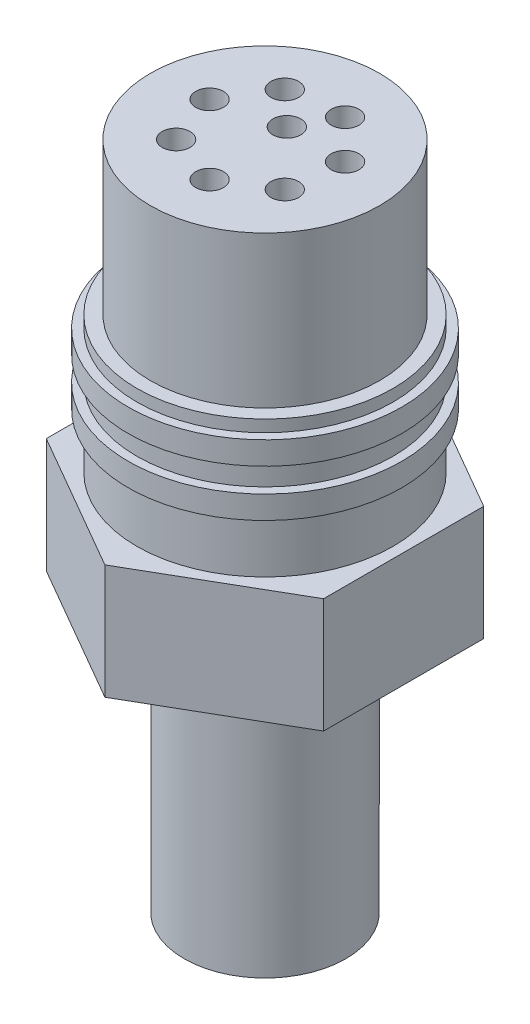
from build123d import *

# Parameters (mm, degrees)
EXTRUDE1_DEPTH    = 7.874
SKETCH3_R         = 7.875
EXTRUDE2_DEPTH    = 10.41
SKETCH4_R         = 0.955
EXTRUDE8_DEPTH    = 10.41
CIRPATTERN1_COUNT = 7
SKETCH_1_R        = 0.955
EXTRUDE9_DEPTH    = 10.41
SKETCH8_R         = 5.55625
EXTRUDE7_DEPTH    = 18.28030303


with BuildPart() as part:
    # Sketch1 → Extrude1 (new body)
    with BuildSketch(Plane(origin=(0, 0, 0), x_dir=(1, 0, 0), z_dir=(0, 1, 0))):
        Polygon((0, 10.998522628), (-9.525, 5.499261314), (-9.525, -5.499261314), (0, -10.998522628), (9.525, -5.499261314), (9.525, 5.499261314), align=None)
    extrude(amount=EXTRUDE1_DEPTH)

    # Sketch2 → Revolve1 (revolve)
    with BuildSketch(Plane.XY, mode=Mode.PRIVATE) as revolve1_sk:
        Polygon((8.8011, 7.874), (8.8011, 11.6586), (9.398, 11.6586), (9.398, 13.2334), (8.8011, 13.2334), (8.8011, 14.8844), (9.398, 14.8844), (9.398, 16.4592), (8.8011, 16.4592), (8.8011, 17.272), (0, 17.272), (0, 7.874), align=None)
    revolve(revolve1_sk.sketch.rotate(Axis((0, 0, 0), (0, -1, 0)), 180), axis=Axis((0, 0, 0), (0, -1, 0)))

    # Sketch3 → Extrude2 (add)
    with BuildSketch(Plane(origin=(0, 17.272, 0), x_dir=(-1, 0, 0), z_dir=(0, 1, 0))):
        with Locations(Location((0, 0, 0), (0, 0, 180))):
            Circle(SKETCH3_R)
    extrude(amount=EXTRUDE2_DEPTH)

    # Sketch4 → Extrude8 (cut)
    with BuildSketch(Plane(origin=(0, 27.682, 0), x_dir=(-1, 0, 0), z_dir=(0, 1, 0))):
        with Locations((3.053287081, 3.053287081)):
            Circle(SKETCH4_R)
    extrude8 = extrude(amount=-EXTRUDE8_DEPTH, mode=Mode.SUBTRACT)

    # CirPattern1: Extrude8 ×7 about axis
    cirpattern1_axis = Axis((0, 0, 0), (0, 1, 0))
    for i in range(1, CIRPATTERN1_COUNT):
        add(extrude8.rotate(cirpattern1_axis, i * 360 / CIRPATTERN1_COUNT), mode=Mode.SUBTRACT)

    # Sketch 1 → Extrude9 (cut)
    with BuildSketch(Plane(origin=(0.09953018, 27.682, 4.480198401), x_dir=(-1, 0, 0), z_dir=(0, 1, 0))):
        with Locations((0.09953018, -5.980198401)):
            Circle(SKETCH_1_R)
    extrude(amount=-EXTRUDE9_DEPTH, mode=Mode.SUBTRACT)

    # Sketch8 → Extrude7 (add)
    with BuildSketch(Plane.XZ):
        with Locations(Location((0, 0, 0), (0, 0, 90))):
            Circle(SKETCH8_R)
    extrude(amount=EXTRUDE7_DEPTH)


solid = part.part
